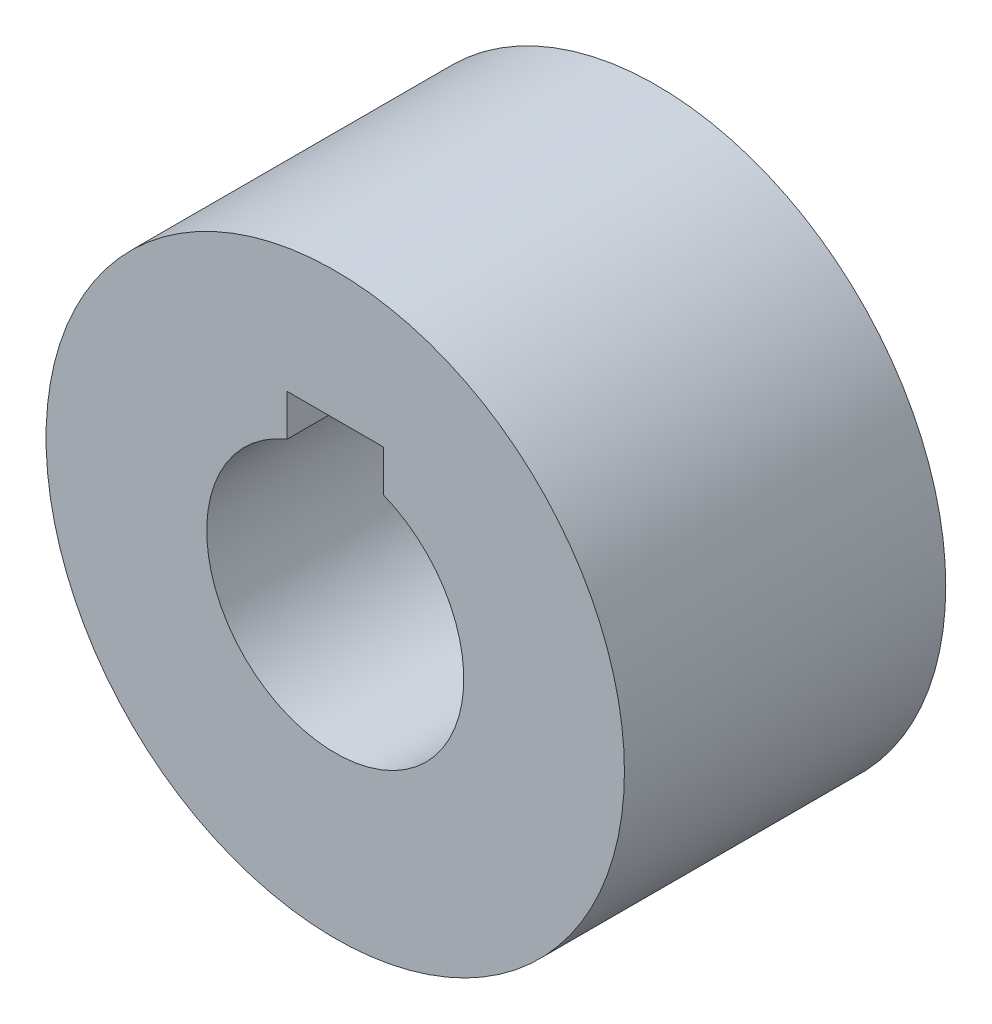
from build123d import *

# Parameters (mm, degrees)
SKETCH_1_R      = 18
EXTRUDE_1_DEPTH = 20


with BuildPart() as part:
    # Sketch 1 → Extrude 1 (new body)
    with BuildSketch(Plane.XY):
        Circle(SKETCH_1_R)
        with BuildLine():
            Line((-3, 7.416198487), (-3, 10))
            Line((-3, 10), (3, 10))
            Line((3, 10), (3, 7.416198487))
            ThreePointArc((3, 7.416198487), (0, -8), (-3, 7.416198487))
        make_face(mode=Mode.SUBTRACT)
    extrude(amount=EXTRUDE_1_DEPTH)


solid = part.part
